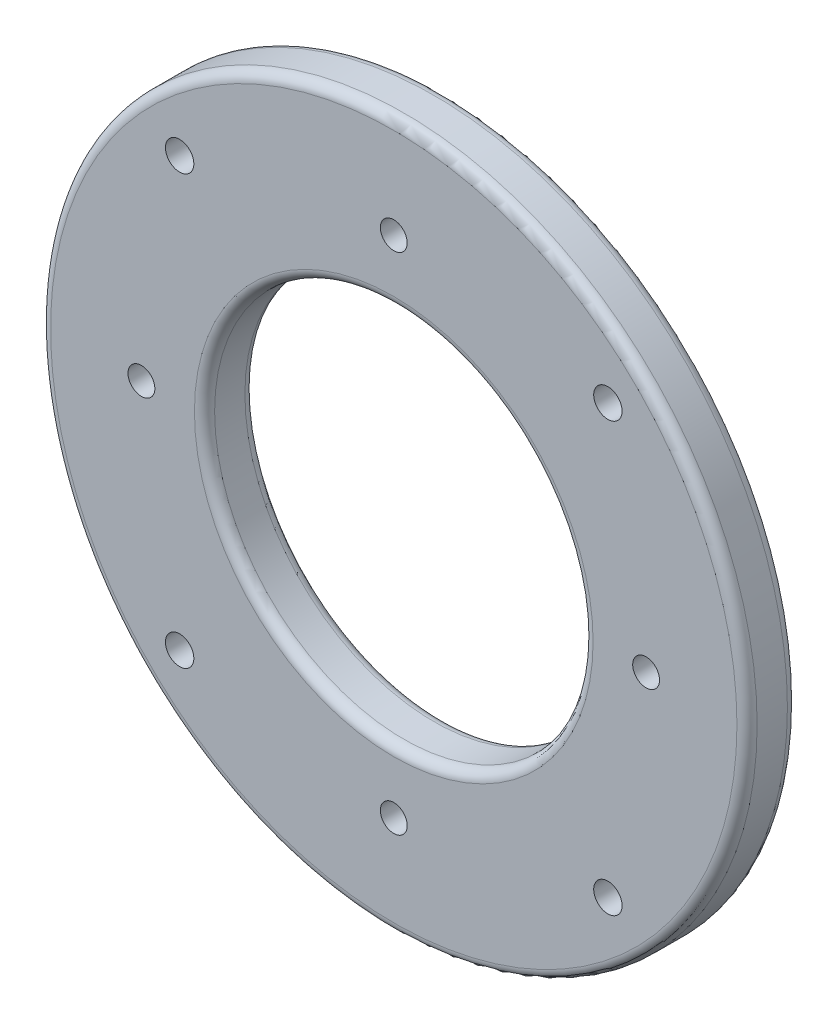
ISO-10303-21;
HEADER;
FILE_DESCRIPTION(('STEP AP214'),'2;1');
FILE_NAME('part.step','',(''),(''),'','','');
FILE_SCHEMA(('AUTOMOTIVE_DESIGN { 1 0 10303 214 1 1 1 1 }'));
ENDSEC;
DATA;
#1=APPLICATION_CONTEXT('core data for automotive mechanical design processes');
#2=APPLICATION_PROTOCOL_DEFINITION('international standard','automotive_design',2000,#1);
#3=PRODUCT_CONTEXT('',#1,'mechanical');
#4=PRODUCT('Part','Part','',(#3));
#5=PRODUCT_RELATED_PRODUCT_CATEGORY('part','',(#4));
#6=PRODUCT_DEFINITION_FORMATION('','',#4);
#7=PRODUCT_DEFINITION_CONTEXT('part definition',#1,'design');
#8=PRODUCT_DEFINITION('design','',#6,#7);
#9=PRODUCT_DEFINITION_SHAPE('','',#8);
#10=(LENGTH_UNIT() NAMED_UNIT(*) SI_UNIT(.MILLI.,.METRE.));
#11=(NAMED_UNIT(*) PLANE_ANGLE_UNIT() SI_UNIT($,.RADIAN.));
#12=(NAMED_UNIT(*) SI_UNIT($,.STERADIAN.) SOLID_ANGLE_UNIT());
#13=UNCERTAINTY_MEASURE_WITH_UNIT(LENGTH_MEASURE(1.E-05),#10,'distance_accuracy_value','');
#14=(GEOMETRIC_REPRESENTATION_CONTEXT(3) GLOBAL_UNCERTAINTY_ASSIGNED_CONTEXT((#13)) GLOBAL_UNIT_ASSIGNED_CONTEXT((#10,
#11,#12)) REPRESENTATION_CONTEXT('',''));
#15=CARTESIAN_POINT('',(0.,0.,0.));
#16=DIRECTION('',(0.,0.,1.));
#17=DIRECTION('',(1.,0.,0.));
#18=AXIS2_PLACEMENT_3D('',#15,#16,#17);
#19=CARTESIAN_POINT('',(0.,0.,12.7));
#20=DIRECTION('',(0.,0.,1.));
#21=DIRECTION('',(1.,0.,0.));
#22=AXIS2_PLACEMENT_3D('',#19,#20,#21);
#23=PLANE('',#22);
#24=CARTESIAN_POINT('',(0.,0.,12.7));
#25=DIRECTION('',(0.,0.,1.));
#26=DIRECTION('',(1.,0.,0.));
#27=AXIS2_PLACEMENT_3D('',#24,#25,#26);
#28=CIRCLE('',#27,86.36);
#29=CARTESIAN_POINT('',(86.36,0.,12.7));
#30=VERTEX_POINT('',#29);
#31=EDGE_CURVE('E52',#30,#30,#28,.T.);
#32=ORIENTED_EDGE('',*,*,#31,.T.);
#33=EDGE_LOOP('',(#32));
#34=FACE_BOUND('',#33,.T.);
#35=CARTESIAN_POINT('',(0.,0.,12.7));
#36=DIRECTION('',(0.,0.,1.));
#37=DIRECTION('',(1.,0.,0.));
#38=AXIS2_PLACEMENT_3D('',#35,#36,#37);
#39=CIRCLE('',#38,50.165);
#40=CARTESIAN_POINT('',(50.165,0.,12.7));
#41=VERTEX_POINT('',#40);
#42=EDGE_CURVE('E58',#41,#41,#39,.F.);
#43=ORIENTED_EDGE('',*,*,#42,.T.);
#44=EDGE_LOOP('',(#43));
#45=FACE_BOUND('',#44,.T.);
#46=CARTESIAN_POINT('',(53.8815367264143,53.8815367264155,12.7));
#47=DIRECTION('',(0.,0.,1.));
#48=DIRECTION('',(1.,0.,0.));
#49=AXIS2_PLACEMENT_3D('',#46,#47,#48);
#50=CIRCLE('',#49,3.57124);
#51=CARTESIAN_POINT('',(57.4527767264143,53.8815367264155,12.7));
#52=VERTEX_POINT('',#51);
#53=EDGE_CURVE('E138',#52,#52,#50,.T.);
#54=ORIENTED_EDGE('',*,*,#53,.F.);
#55=EDGE_LOOP('',(#54));
#56=FACE_BOUND('',#55,.T.);
#57=CARTESIAN_POINT('',(53.8815367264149,-53.8815367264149,12.7));
#58=DIRECTION('',(0.,0.,1.));
#59=DIRECTION('',(1.,0.,0.));
#60=AXIS2_PLACEMENT_3D('',#57,#58,#59);
#61=CIRCLE('',#60,3.57124);
#62=CARTESIAN_POINT('',(57.4527767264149,-53.8815367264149,12.7));
#63=VERTEX_POINT('',#62);
#64=EDGE_CURVE('E130',#63,#63,#61,.T.);
#65=ORIENTED_EDGE('',*,*,#64,.F.);
#66=EDGE_LOOP('',(#65));
#67=FACE_BOUND('',#66,.T.);
#68=CARTESIAN_POINT('',(-53.8815367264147,-53.8815367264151,12.7));
#69=DIRECTION('',(0.,0.,1.));
#70=DIRECTION('',(1.,0.,0.));
#71=AXIS2_PLACEMENT_3D('',#68,#69,#70);
#72=CIRCLE('',#71,3.57124);
#73=CARTESIAN_POINT('',(-50.3102967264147,-53.8815367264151,12.7));
#74=VERTEX_POINT('',#73);
#75=EDGE_CURVE('E122',#74,#74,#72,.T.);
#76=ORIENTED_EDGE('',*,*,#75,.F.);
#77=EDGE_LOOP('',(#76));
#78=FACE_BOUND('',#77,.T.);
#79=CARTESIAN_POINT('',(-53.8815367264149,53.8815367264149,12.7));
#80=DIRECTION('',(0.,0.,1.));
#81=DIRECTION('',(1.,0.,0.));
#82=AXIS2_PLACEMENT_3D('',#79,#80,#81);
#83=CIRCLE('',#82,3.57124);
#84=CARTESIAN_POINT('',(-50.3102967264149,53.8815367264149,12.7));
#85=VERTEX_POINT('',#84);
#86=EDGE_CURVE('E114',#85,#85,#83,.T.);
#87=ORIENTED_EDGE('',*,*,#86,.F.);
#88=EDGE_LOOP('',(#87));
#89=FACE_BOUND('',#88,.T.);
#90=CARTESIAN_POINT('',(-63.5,0.,12.7));
#91=DIRECTION('',(0.,0.,1.));
#92=DIRECTION('',(1.,0.,0.));
#93=AXIS2_PLACEMENT_3D('',#90,#91,#92);
#94=CIRCLE('',#93,3.3782);
#95=CARTESIAN_POINT('',(-60.1218,0.,12.7));
#96=VERTEX_POINT('',#95);
#97=EDGE_CURVE('E106',#96,#96,#94,.T.);
#98=ORIENTED_EDGE('',*,*,#97,.F.);
#99=EDGE_LOOP('',(#98));
#100=FACE_BOUND('',#99,.T.);
#101=CARTESIAN_POINT('',(63.5,0.,12.7));
#102=DIRECTION('',(0.,0.,1.));
#103=DIRECTION('',(1.,0.,0.));
#104=AXIS2_PLACEMENT_3D('',#101,#102,#103);
#105=CIRCLE('',#104,3.3782);
#106=CARTESIAN_POINT('',(66.8782,0.,12.7));
#107=VERTEX_POINT('',#106);
#108=EDGE_CURVE('E99',#107,#107,#105,.T.);
#109=ORIENTED_EDGE('',*,*,#108,.F.);
#110=EDGE_LOOP('',(#109));
#111=FACE_BOUND('',#110,.T.);
#112=CARTESIAN_POINT('',(0.,-63.5,12.7));
#113=DIRECTION('',(0.,0.,1.));
#114=DIRECTION('',(1.,0.,0.));
#115=AXIS2_PLACEMENT_3D('',#112,#113,#114);
#116=CIRCLE('',#115,3.3782);
#117=CARTESIAN_POINT('',(3.3782,-63.5,12.7));
#118=VERTEX_POINT('',#117);
#119=EDGE_CURVE('E91',#118,#118,#116,.T.);
#120=ORIENTED_EDGE('',*,*,#119,.F.);
#121=EDGE_LOOP('',(#120));
#122=FACE_BOUND('',#121,.T.);
#123=CARTESIAN_POINT('',(0.,63.5,12.7));
#124=DIRECTION('',(0.,0.,1.));
#125=DIRECTION('',(1.,0.,0.));
#126=AXIS2_PLACEMENT_3D('',#123,#124,#125);
#127=CIRCLE('',#126,3.3782);
#128=CARTESIAN_POINT('',(3.37819999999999,63.5,12.7));
#129=VERTEX_POINT('',#128);
#130=EDGE_CURVE('E83',#129,#129,#127,.T.);
#131=ORIENTED_EDGE('',*,*,#130,.F.);
#132=EDGE_LOOP('',(#131));
#133=FACE_BOUND('',#132,.T.);
#134=ADVANCED_FACE('F38',(#34,#45,#56,#67,#78,#89,#100,#111,#122,#133),#23,.T.);
#135=CARTESIAN_POINT('',(0.,0.,0.));
#136=DIRECTION('',(0.,0.,1.));
#137=DIRECTION('',(1.,0.,0.));
#138=AXIS2_PLACEMENT_3D('',#135,#136,#137);
#139=PLANE('',#138);
#140=CARTESIAN_POINT('',(0.,0.,0.));
#141=DIRECTION('',(0.,0.,1.));
#142=DIRECTION('',(1.,0.,0.));
#143=AXIS2_PLACEMENT_3D('',#140,#141,#142);
#144=CIRCLE('',#143,86.36);
#145=CARTESIAN_POINT('',(86.36,0.,0.));
#146=VERTEX_POINT('',#145);
#147=EDGE_CURVE('E64',#146,#146,#144,.F.);
#148=ORIENTED_EDGE('',*,*,#147,.T.);
#149=EDGE_LOOP('',(#148));
#150=FACE_BOUND('',#149,.T.);
#151=CARTESIAN_POINT('',(0.,0.,0.));
#152=DIRECTION('',(0.,0.,1.));
#153=DIRECTION('',(1.,0.,0.));
#154=AXIS2_PLACEMENT_3D('',#151,#152,#153);
#155=CIRCLE('',#154,50.165);
#156=CARTESIAN_POINT('',(50.165,0.,0.));
#157=VERTEX_POINT('',#156);
#158=EDGE_CURVE('E68',#157,#157,#155,.T.);
#159=ORIENTED_EDGE('',*,*,#158,.T.);
#160=EDGE_LOOP('',(#159));
#161=FACE_BOUND('',#160,.T.);
#162=CARTESIAN_POINT('',(53.8815367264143,53.8815367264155,0.));
#163=DIRECTION('',(0.,0.,1.));
#164=DIRECTION('',(1.,0.,0.));
#165=AXIS2_PLACEMENT_3D('',#162,#163,#164);
#166=CIRCLE('',#165,3.57124);
#167=CARTESIAN_POINT('',(57.4527767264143,53.8815367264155,0.));
#168=VERTEX_POINT('',#167);
#169=EDGE_CURVE('E134',#168,#168,#166,.T.);
#170=ORIENTED_EDGE('',*,*,#169,.T.);
#171=EDGE_LOOP('',(#170));
#172=FACE_BOUND('',#171,.T.);
#173=CARTESIAN_POINT('',(53.8815367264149,-53.8815367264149,0.));
#174=DIRECTION('',(0.,0.,1.));
#175=DIRECTION('',(1.,0.,0.));
#176=AXIS2_PLACEMENT_3D('',#173,#174,#175);
#177=CIRCLE('',#176,3.57124);
#178=CARTESIAN_POINT('',(57.4527767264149,-53.8815367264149,0.));
#179=VERTEX_POINT('',#178);
#180=EDGE_CURVE('E126',#179,#179,#177,.T.);
#181=ORIENTED_EDGE('',*,*,#180,.T.);
#182=EDGE_LOOP('',(#181));
#183=FACE_BOUND('',#182,.T.);
#184=CARTESIAN_POINT('',(-53.8815367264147,-53.8815367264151,0.));
#185=DIRECTION('',(0.,0.,1.));
#186=DIRECTION('',(1.,0.,0.));
#187=AXIS2_PLACEMENT_3D('',#184,#185,#186);
#188=CIRCLE('',#187,3.57124);
#189=CARTESIAN_POINT('',(-50.3102967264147,-53.8815367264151,0.));
#190=VERTEX_POINT('',#189);
#191=EDGE_CURVE('E118',#190,#190,#188,.T.);
#192=ORIENTED_EDGE('',*,*,#191,.T.);
#193=EDGE_LOOP('',(#192));
#194=FACE_BOUND('',#193,.T.);
#195=CARTESIAN_POINT('',(-53.8815367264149,53.8815367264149,0.));
#196=DIRECTION('',(0.,0.,1.));
#197=DIRECTION('',(1.,0.,0.));
#198=AXIS2_PLACEMENT_3D('',#195,#196,#197);
#199=CIRCLE('',#198,3.57124);
#200=CARTESIAN_POINT('',(-50.3102967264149,53.8815367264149,0.));
#201=VERTEX_POINT('',#200);
#202=EDGE_CURVE('E110',#201,#201,#199,.T.);
#203=ORIENTED_EDGE('',*,*,#202,.T.);
#204=EDGE_LOOP('',(#203));
#205=FACE_BOUND('',#204,.T.);
#206=CARTESIAN_POINT('',(-63.5,0.,0.));
#207=DIRECTION('',(0.,0.,1.));
#208=DIRECTION('',(1.,0.,0.));
#209=AXIS2_PLACEMENT_3D('',#206,#207,#208);
#210=CIRCLE('',#209,3.3782);
#211=CARTESIAN_POINT('',(-60.1218,0.,0.));
#212=VERTEX_POINT('',#211);
#213=EDGE_CURVE('E102',#212,#212,#210,.T.);
#214=ORIENTED_EDGE('',*,*,#213,.T.);
#215=EDGE_LOOP('',(#214));
#216=FACE_BOUND('',#215,.T.);
#217=CARTESIAN_POINT('',(63.5,0.,0.));
#218=DIRECTION('',(0.,0.,1.));
#219=DIRECTION('',(1.,0.,0.));
#220=AXIS2_PLACEMENT_3D('',#217,#218,#219);
#221=CIRCLE('',#220,3.3782);
#222=CARTESIAN_POINT('',(66.8782,0.,0.));
#223=VERTEX_POINT('',#222);
#224=EDGE_CURVE('E95',#223,#223,#221,.T.);
#225=ORIENTED_EDGE('',*,*,#224,.T.);
#226=EDGE_LOOP('',(#225));
#227=FACE_BOUND('',#226,.T.);
#228=CARTESIAN_POINT('',(0.,-63.5,0.));
#229=DIRECTION('',(0.,0.,1.));
#230=DIRECTION('',(1.,0.,0.));
#231=AXIS2_PLACEMENT_3D('',#228,#229,#230);
#232=CIRCLE('',#231,3.3782);
#233=CARTESIAN_POINT('',(3.3782,-63.5,0.));
#234=VERTEX_POINT('',#233);
#235=EDGE_CURVE('E87',#234,#234,#232,.T.);
#236=ORIENTED_EDGE('',*,*,#235,.T.);
#237=EDGE_LOOP('',(#236));
#238=FACE_BOUND('',#237,.T.);
#239=CARTESIAN_POINT('',(0.,63.5,0.));
#240=DIRECTION('',(0.,0.,1.));
#241=DIRECTION('',(1.,0.,0.));
#242=AXIS2_PLACEMENT_3D('',#239,#240,#241);
#243=CIRCLE('',#242,3.3782);
#244=CARTESIAN_POINT('',(3.37819999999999,63.5,0.));
#245=VERTEX_POINT('',#244);
#246=EDGE_CURVE('E79',#245,#245,#243,.T.);
#247=ORIENTED_EDGE('',*,*,#246,.T.);
#248=EDGE_LOOP('',(#247));
#249=FACE_BOUND('',#248,.T.);
#250=ADVANCED_FACE('F147',(#150,#161,#172,#183,#194,#205,#216,#227,#238,#249),#139,.F.);
#251=CARTESIAN_POINT('',(0.,0.,12.7));
#252=DIRECTION('',(0.,0.,-1.));
#253=DIRECTION('',(-1.,0.,0.));
#254=AXIS2_PLACEMENT_3D('',#251,#252,#253);
#255=CYLINDRICAL_SURFACE('',#254,88.9);
#256=CARTESIAN_POINT('',(0.,0.,2.54));
#257=DIRECTION('',(0.,0.,1.));
#258=DIRECTION('',(1.,0.,0.));
#259=AXIS2_PLACEMENT_3D('',#256,#257,#258);
#260=CIRCLE('',#259,88.9);
#261=CARTESIAN_POINT('',(88.9,0.,2.54));
#262=VERTEX_POINT('',#261);
#263=EDGE_CURVE('E71',#262,#262,#260,.T.);
#264=ORIENTED_EDGE('',*,*,#263,.T.);
#265=EDGE_LOOP('',(#264));
#266=FACE_BOUND('',#265,.T.);
#267=CARTESIAN_POINT('',(0.,0.,10.16));
#268=DIRECTION('',(0.,0.,1.));
#269=DIRECTION('',(1.,0.,0.));
#270=AXIS2_PLACEMENT_3D('',#267,#268,#269);
#271=CIRCLE('',#270,88.9);
#272=CARTESIAN_POINT('',(88.9,0.,10.16));
#273=VERTEX_POINT('',#272);
#274=EDGE_CURVE('E75',#273,#273,#271,.F.);
#275=ORIENTED_EDGE('',*,*,#274,.T.);
#276=EDGE_LOOP('',(#275));
#277=FACE_BOUND('',#276,.T.);
#278=ADVANCED_FACE('F177',(#266,#277),#255,.T.);
#279=CARTESIAN_POINT('',(0.,0.,12.7));
#280=DIRECTION('',(0.,0.,-1.));
#281=DIRECTION('',(-1.,0.,0.));
#282=AXIS2_PLACEMENT_3D('',#279,#280,#281);
#283=CYLINDRICAL_SURFACE('',#282,47.625);
#284=CARTESIAN_POINT('',(0.,0.,2.54));
#285=DIRECTION('',(0.,0.,1.));
#286=DIRECTION('',(1.,0.,0.));
#287=AXIS2_PLACEMENT_3D('',#284,#285,#286);
#288=CIRCLE('',#287,47.625);
#289=CARTESIAN_POINT('',(47.625,0.,2.54));
#290=VERTEX_POINT('',#289);
#291=EDGE_CURVE('E10',#290,#290,#288,.F.);
#292=ORIENTED_EDGE('',*,*,#291,.T.);
#293=EDGE_LOOP('',(#292));
#294=FACE_BOUND('',#293,.T.);
#295=CARTESIAN_POINT('',(0.,0.,10.16));
#296=DIRECTION('',(0.,0.,1.));
#297=DIRECTION('',(1.,0.,0.));
#298=AXIS2_PLACEMENT_3D('',#295,#296,#297);
#299=CIRCLE('',#298,47.625);
#300=CARTESIAN_POINT('',(47.625,0.,10.16));
#301=VERTEX_POINT('',#300);
#302=EDGE_CURVE('E46',#301,#301,#299,.T.);
#303=ORIENTED_EDGE('',*,*,#302,.T.);
#304=EDGE_LOOP('',(#303));
#305=FACE_BOUND('',#304,.T.);
#306=ADVANCED_FACE('F167',(#294,#305),#283,.F.);
#307=CARTESIAN_POINT('',(0.,63.5,12.7));
#308=DIRECTION('',(0.,0.,1.));
#309=DIRECTION('',(1.,0.,0.));
#310=AXIS2_PLACEMENT_3D('',#307,#308,#309);
#311=CYLINDRICAL_SURFACE('',#310,3.3782);
#312=ORIENTED_EDGE('',*,*,#246,.F.);
#313=EDGE_LOOP('',(#312));
#314=FACE_BOUND('',#313,.T.);
#315=ORIENTED_EDGE('',*,*,#130,.T.);
#316=EDGE_LOOP('',(#315));
#317=FACE_BOUND('',#316,.T.);
#318=ADVANCED_FACE('F164',(#314,#317),#311,.F.);
#319=CARTESIAN_POINT('',(0.,-63.5,12.7));
#320=DIRECTION('',(0.,0.,1.));
#321=DIRECTION('',(1.,0.,0.));
#322=AXIS2_PLACEMENT_3D('',#319,#320,#321);
#323=CYLINDRICAL_SURFACE('',#322,3.3782);
#324=ORIENTED_EDGE('',*,*,#235,.F.);
#325=EDGE_LOOP('',(#324));
#326=FACE_BOUND('',#325,.T.);
#327=ORIENTED_EDGE('',*,*,#119,.T.);
#328=EDGE_LOOP('',(#327));
#329=FACE_BOUND('',#328,.T.);
#330=ADVANCED_FACE('F166',(#326,#329),#323,.F.);
#331=CARTESIAN_POINT('',(63.5,0.,12.7));
#332=DIRECTION('',(0.,0.,1.));
#333=DIRECTION('',(1.,0.,0.));
#334=AXIS2_PLACEMENT_3D('',#331,#332,#333);
#335=CYLINDRICAL_SURFACE('',#334,3.3782);
#336=ORIENTED_EDGE('',*,*,#224,.F.);
#337=EDGE_LOOP('',(#336));
#338=FACE_BOUND('',#337,.T.);
#339=ORIENTED_EDGE('',*,*,#108,.T.);
#340=EDGE_LOOP('',(#339));
#341=FACE_BOUND('',#340,.T.);
#342=ADVANCED_FACE('F174',(#338,#341),#335,.F.);
#343=CARTESIAN_POINT('',(-63.5,0.,12.7));
#344=DIRECTION('',(0.,0.,1.));
#345=DIRECTION('',(1.,0.,0.));
#346=AXIS2_PLACEMENT_3D('',#343,#344,#345);
#347=CYLINDRICAL_SURFACE('',#346,3.3782);
#348=ORIENTED_EDGE('',*,*,#213,.F.);
#349=EDGE_LOOP('',(#348));
#350=FACE_BOUND('',#349,.T.);
#351=ORIENTED_EDGE('',*,*,#97,.T.);
#352=EDGE_LOOP('',(#351));
#353=FACE_BOUND('',#352,.T.);
#354=ADVANCED_FACE('F224',(#350,#353),#347,.F.);
#355=CARTESIAN_POINT('',(-53.8815367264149,53.8815367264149,12.7));
#356=DIRECTION('',(0.,0.,1.));
#357=DIRECTION('',(1.,0.,0.));
#358=AXIS2_PLACEMENT_3D('',#355,#356,#357);
#359=CYLINDRICAL_SURFACE('',#358,3.57124);
#360=ORIENTED_EDGE('',*,*,#202,.F.);
#361=EDGE_LOOP('',(#360));
#362=FACE_BOUND('',#361,.T.);
#363=ORIENTED_EDGE('',*,*,#86,.T.);
#364=EDGE_LOOP('',(#363));
#365=FACE_BOUND('',#364,.T.);
#366=ADVANCED_FACE('F228',(#362,#365),#359,.F.);
#367=CARTESIAN_POINT('',(-53.8815367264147,-53.8815367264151,12.7));
#368=DIRECTION('',(0.,0.,1.));
#369=DIRECTION('',(1.,0.,0.));
#370=AXIS2_PLACEMENT_3D('',#367,#368,#369);
#371=CYLINDRICAL_SURFACE('',#370,3.57124);
#372=ORIENTED_EDGE('',*,*,#191,.F.);
#373=EDGE_LOOP('',(#372));
#374=FACE_BOUND('',#373,.T.);
#375=ORIENTED_EDGE('',*,*,#75,.T.);
#376=EDGE_LOOP('',(#375));
#377=FACE_BOUND('',#376,.T.);
#378=ADVANCED_FACE('F234',(#374,#377),#371,.F.);
#379=CARTESIAN_POINT('',(53.8815367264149,-53.8815367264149,12.7));
#380=DIRECTION('',(0.,0.,1.));
#381=DIRECTION('',(1.,0.,0.));
#382=AXIS2_PLACEMENT_3D('',#379,#380,#381);
#383=CYLINDRICAL_SURFACE('',#382,3.57124);
#384=ORIENTED_EDGE('',*,*,#180,.F.);
#385=EDGE_LOOP('',(#384));
#386=FACE_BOUND('',#385,.T.);
#387=ORIENTED_EDGE('',*,*,#64,.T.);
#388=EDGE_LOOP('',(#387));
#389=FACE_BOUND('',#388,.T.);
#390=ADVANCED_FACE('F238',(#386,#389),#383,.F.);
#391=CARTESIAN_POINT('',(53.8815367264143,53.8815367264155,12.7));
#392=DIRECTION('',(0.,0.,1.));
#393=DIRECTION('',(1.,0.,0.));
#394=AXIS2_PLACEMENT_3D('',#391,#392,#393);
#395=CYLINDRICAL_SURFACE('',#394,3.57124);
#396=ORIENTED_EDGE('',*,*,#169,.F.);
#397=EDGE_LOOP('',(#396));
#398=FACE_BOUND('',#397,.T.);
#399=ORIENTED_EDGE('',*,*,#53,.T.);
#400=EDGE_LOOP('',(#399));
#401=FACE_BOUND('',#400,.T.);
#402=ADVANCED_FACE('F143',(#398,#401),#395,.F.);
#403=CARTESIAN_POINT('',(0.,0.,2.54));
#404=DIRECTION('',(0.,0.,1.));
#405=DIRECTION('',(1.,0.,0.));
#406=AXIS2_PLACEMENT_3D('',#403,#404,#405);
#407=TOROIDAL_SURFACE('',#406,86.36,2.54);
#408=ORIENTED_EDGE('',*,*,#147,.F.);
#409=EDGE_LOOP('',(#408));
#410=FACE_BOUND('',#409,.T.);
#411=ORIENTED_EDGE('',*,*,#263,.F.);
#412=EDGE_LOOP('',(#411));
#413=FACE_BOUND('',#412,.T.);
#414=ADVANCED_FACE('F188',(#410,#413),#407,.T.);
#415=CARTESIAN_POINT('',(0.,0.,10.16));
#416=DIRECTION('',(0.,0.,1.));
#417=DIRECTION('',(1.,0.,0.));
#418=AXIS2_PLACEMENT_3D('',#415,#416,#417);
#419=TOROIDAL_SURFACE('',#418,86.36,2.54);
#420=ORIENTED_EDGE('',*,*,#274,.F.);
#421=EDGE_LOOP('',(#420));
#422=FACE_BOUND('',#421,.T.);
#423=ORIENTED_EDGE('',*,*,#31,.F.);
#424=EDGE_LOOP('',(#423));
#425=FACE_BOUND('',#424,.T.);
#426=ADVANCED_FACE('F191',(#422,#425),#419,.T.);
#427=CARTESIAN_POINT('',(0.,0.,2.54));
#428=DIRECTION('',(0.,0.,1.));
#429=DIRECTION('',(1.,0.,0.));
#430=AXIS2_PLACEMENT_3D('',#427,#428,#429);
#431=TOROIDAL_SURFACE('',#430,50.165,2.54);
#432=ORIENTED_EDGE('',*,*,#291,.F.);
#433=EDGE_LOOP('',(#432));
#434=FACE_BOUND('',#433,.T.);
#435=ORIENTED_EDGE('',*,*,#158,.F.);
#436=EDGE_LOOP('',(#435));
#437=FACE_BOUND('',#436,.T.);
#438=ADVANCED_FACE('F194',(#434,#437),#431,.T.);
#439=CARTESIAN_POINT('',(0.,0.,10.16));
#440=DIRECTION('',(0.,0.,1.));
#441=DIRECTION('',(1.,0.,0.));
#442=AXIS2_PLACEMENT_3D('',#439,#440,#441);
#443=TOROIDAL_SURFACE('',#442,50.165,2.54);
#444=ORIENTED_EDGE('',*,*,#42,.F.);
#445=EDGE_LOOP('',(#444));
#446=FACE_BOUND('',#445,.T.);
#447=ORIENTED_EDGE('',*,*,#302,.F.);
#448=EDGE_LOOP('',(#447));
#449=FACE_BOUND('',#448,.T.);
#450=ADVANCED_FACE('F40',(#446,#449),#443,.T.);
#451=CLOSED_SHELL('',(#134,#250,#278,#306,#318,#330,#342,#354,#366,#378,#390,#402,#414,#426,
#438,#450));
#452=MANIFOLD_SOLID_BREP('B2',#451);
#453=ADVANCED_BREP_SHAPE_REPRESENTATION('',(#18,#452),#14);
#454=SHAPE_DEFINITION_REPRESENTATION(#9,#453);
ENDSEC;
END-ISO-10303-21;
